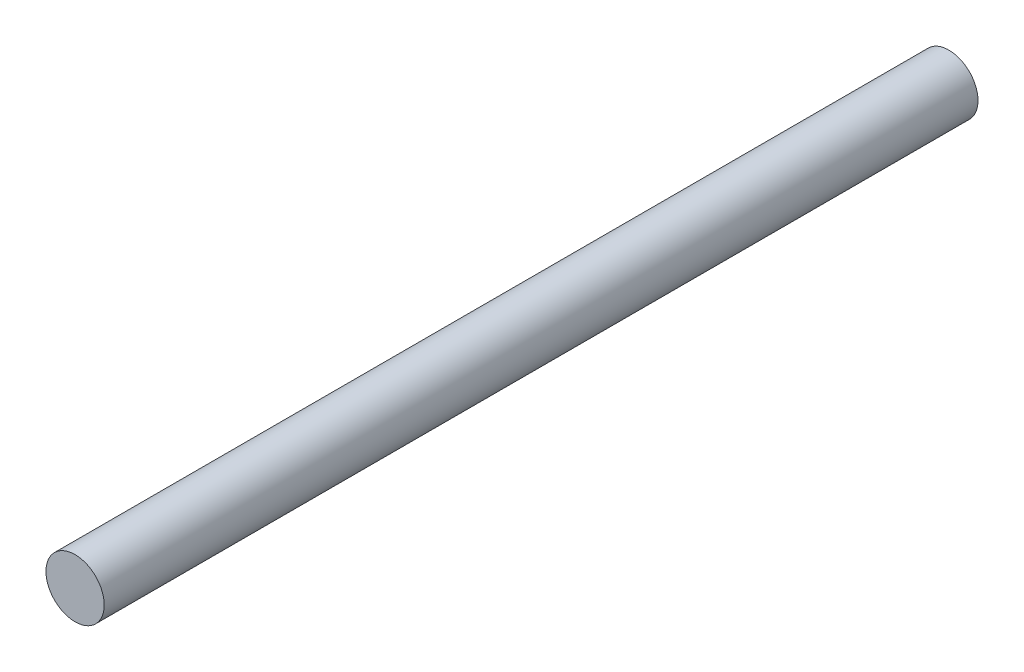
ISO-10303-21;
HEADER;
FILE_DESCRIPTION(('STEP AP214'),'2;1');
FILE_NAME('part.step','',(''),(''),'','','');
FILE_SCHEMA(('AUTOMOTIVE_DESIGN { 1 0 10303 214 1 1 1 1 }'));
ENDSEC;
DATA;
#1=APPLICATION_CONTEXT('core data for automotive mechanical design processes');
#2=APPLICATION_PROTOCOL_DEFINITION('international standard','automotive_design',2000,#1);
#3=PRODUCT_CONTEXT('',#1,'mechanical');
#4=PRODUCT('Part','Part','',(#3));
#5=PRODUCT_RELATED_PRODUCT_CATEGORY('part','',(#4));
#6=PRODUCT_DEFINITION_FORMATION('','',#4);
#7=PRODUCT_DEFINITION_CONTEXT('part definition',#1,'design');
#8=PRODUCT_DEFINITION('design','',#6,#7);
#9=PRODUCT_DEFINITION_SHAPE('','',#8);
#10=(LENGTH_UNIT() NAMED_UNIT(*) SI_UNIT(.MILLI.,.METRE.));
#11=(NAMED_UNIT(*) PLANE_ANGLE_UNIT() SI_UNIT($,.RADIAN.));
#12=(NAMED_UNIT(*) SI_UNIT($,.STERADIAN.) SOLID_ANGLE_UNIT());
#13=UNCERTAINTY_MEASURE_WITH_UNIT(LENGTH_MEASURE(1.E-05),#10,'distance_accuracy_value','');
#14=(GEOMETRIC_REPRESENTATION_CONTEXT(3) GLOBAL_UNCERTAINTY_ASSIGNED_CONTEXT((#13)) GLOBAL_UNIT_ASSIGNED_CONTEXT((#10,
#11,#12)) REPRESENTATION_CONTEXT('',''));
#15=CARTESIAN_POINT('',(0.,0.,0.));
#16=DIRECTION('',(0.,0.,1.));
#17=DIRECTION('',(1.,0.,0.));
#18=AXIS2_PLACEMENT_3D('',#15,#16,#17);
#19=CARTESIAN_POINT('',(0.,0.,15.));
#20=DIRECTION('',(0.,0.,-1.));
#21=DIRECTION('',(-1.,0.,0.));
#22=AXIS2_PLACEMENT_3D('',#19,#20,#21);
#23=CYLINDRICAL_SURFACE('',#22,0.5);
#24=CARTESIAN_POINT('',(0.,0.,15.));
#25=DIRECTION('',(0.,0.,1.));
#26=DIRECTION('',(1.,0.,0.));
#27=AXIS2_PLACEMENT_3D('',#24,#25,#26);
#28=CIRCLE('',#27,0.5);
#29=CARTESIAN_POINT('',(0.5,0.,15.));
#30=VERTEX_POINT('',#29);
#31=EDGE_CURVE('E10',#30,#30,#28,.T.);
#32=ORIENTED_EDGE('',*,*,#31,.F.);
#33=EDGE_LOOP('',(#32));
#34=FACE_BOUND('',#33,.T.);
#35=CARTESIAN_POINT('',(0.,0.,0.));
#36=DIRECTION('',(0.,0.,1.));
#37=DIRECTION('',(1.,0.,0.));
#38=AXIS2_PLACEMENT_3D('',#35,#36,#37);
#39=CIRCLE('',#38,0.5);
#40=CARTESIAN_POINT('',(0.5,0.,0.));
#41=VERTEX_POINT('',#40);
#42=EDGE_CURVE('E36',#41,#41,#39,.T.);
#43=ORIENTED_EDGE('',*,*,#42,.T.);
#44=EDGE_LOOP('',(#43));
#45=FACE_BOUND('',#44,.T.);
#46=ADVANCED_FACE('F33',(#34,#45),#23,.T.);
#47=CARTESIAN_POINT('',(0.,0.,15.));
#48=DIRECTION('',(0.,0.,1.));
#49=DIRECTION('',(1.,0.,0.));
#50=AXIS2_PLACEMENT_3D('',#47,#48,#49);
#51=PLANE('',#50);
#52=ORIENTED_EDGE('',*,*,#31,.T.);
#53=EDGE_LOOP('',(#52));
#54=FACE_BOUND('',#53,.T.);
#55=ADVANCED_FACE('F48',(#54),#51,.T.);
#56=CARTESIAN_POINT('',(0.,0.,0.));
#57=DIRECTION('',(0.,0.,1.));
#58=DIRECTION('',(1.,0.,0.));
#59=AXIS2_PLACEMENT_3D('',#56,#57,#58);
#60=PLANE('',#59);
#61=ORIENTED_EDGE('',*,*,#42,.F.);
#62=EDGE_LOOP('',(#61));
#63=FACE_BOUND('',#62,.T.);
#64=ADVANCED_FACE('F46',(#63),#60,.F.);
#65=CLOSED_SHELL('',(#46,#55,#64));
#66=MANIFOLD_SOLID_BREP('B2',#65);
#67=ADVANCED_BREP_SHAPE_REPRESENTATION('',(#18,#66),#14);
#68=SHAPE_DEFINITION_REPRESENTATION(#9,#67);
ENDSEC;
END-ISO-10303-21;
